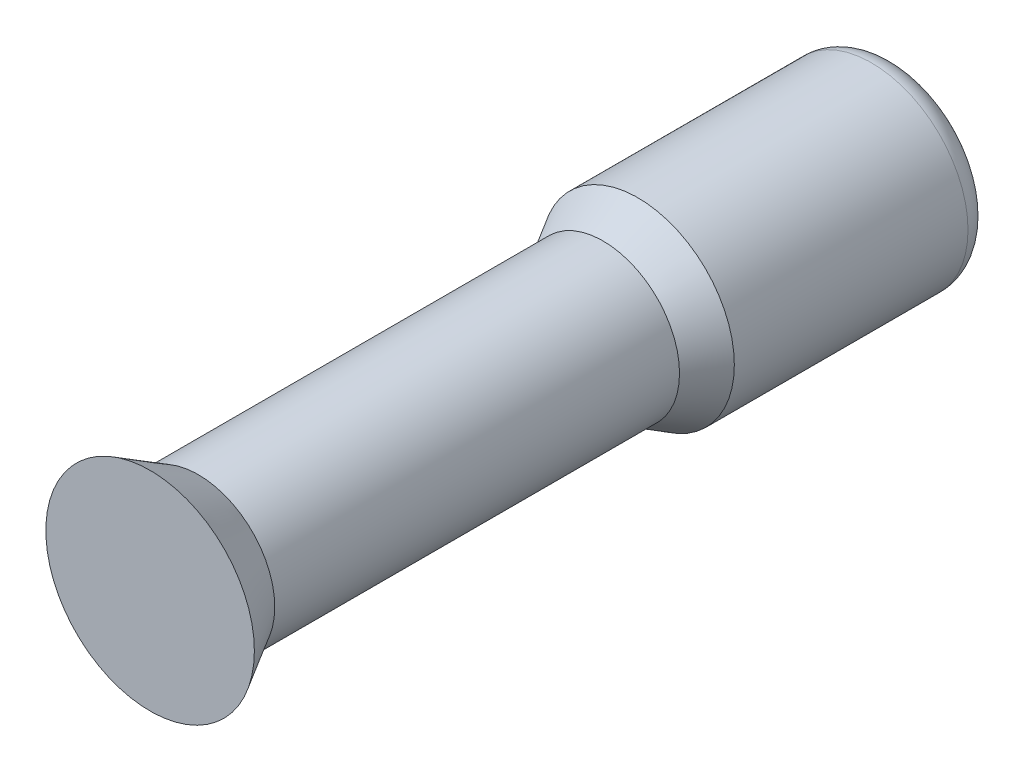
ISO-10303-21;
HEADER;
FILE_DESCRIPTION(('STEP AP214'),'2;1');
FILE_NAME('part.step','',(''),(''),'','','');
FILE_SCHEMA(('AUTOMOTIVE_DESIGN { 1 0 10303 214 1 1 1 1 }'));
ENDSEC;
DATA;
#1=APPLICATION_CONTEXT('core data for automotive mechanical design processes');
#2=APPLICATION_PROTOCOL_DEFINITION('international standard','automotive_design',2000,#1);
#3=PRODUCT_CONTEXT('',#1,'mechanical');
#4=PRODUCT('Part','Part','',(#3));
#5=PRODUCT_RELATED_PRODUCT_CATEGORY('part','',(#4));
#6=PRODUCT_DEFINITION_FORMATION('','',#4);
#7=PRODUCT_DEFINITION_CONTEXT('part definition',#1,'design');
#8=PRODUCT_DEFINITION('design','',#6,#7);
#9=PRODUCT_DEFINITION_SHAPE('','',#8);
#10=(LENGTH_UNIT() NAMED_UNIT(*) SI_UNIT(.MILLI.,.METRE.));
#11=(NAMED_UNIT(*) PLANE_ANGLE_UNIT() SI_UNIT($,.RADIAN.));
#12=(NAMED_UNIT(*) SI_UNIT($,.STERADIAN.) SOLID_ANGLE_UNIT());
#13=UNCERTAINTY_MEASURE_WITH_UNIT(LENGTH_MEASURE(1.E-05),#10,'distance_accuracy_value','');
#14=(GEOMETRIC_REPRESENTATION_CONTEXT(3) GLOBAL_UNCERTAINTY_ASSIGNED_CONTEXT((#13)) GLOBAL_UNIT_ASSIGNED_CONTEXT((#10,
#11,#12)) REPRESENTATION_CONTEXT('',''));
#15=CARTESIAN_POINT('',(0.,0.,0.));
#16=DIRECTION('',(0.,0.,1.));
#17=DIRECTION('',(1.,0.,0.));
#18=AXIS2_PLACEMENT_3D('',#15,#16,#17);
#19=CARTESIAN_POINT('',(0.,0.,0.));
#20=DIRECTION('',(0.,0.,-1.));
#21=DIRECTION('',(-1.,0.,0.));
#22=AXIS2_PLACEMENT_3D('',#19,#20,#21);
#23=PLANE('',#22);
#24=CARTESIAN_POINT('',(0.,0.,0.));
#25=DIRECTION('',(0.,0.,1.));
#26=DIRECTION('',(1.,0.,0.));
#27=AXIS2_PLACEMENT_3D('',#24,#25,#26);
#28=CIRCLE('',#27,1.71557177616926);
#29=CARTESIAN_POINT('',(1.71557177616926,0.,0.));
#30=VERTEX_POINT('',#29);
#31=EDGE_CURVE('E10',#30,#30,#28,.T.);
#32=ORIENTED_EDGE('',*,*,#31,.T.);
#33=EDGE_LOOP('',(#32));
#34=FACE_BOUND('',#33,.T.);
#35=ADVANCED_FACE('F33',(#34),#23,.F.);
#36=CARTESIAN_POINT('',(0.,0.,-0.79375));
#37=DIRECTION('',(0.,0.,1.));
#38=DIRECTION('',(1.,0.,0.));
#39=AXIS2_PLACEMENT_3D('',#36,#37,#38);
#40=CONICAL_SURFACE('',#39,1.2573,0.523598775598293);
#41=ORIENTED_EDGE('',*,*,#31,.F.);
#42=EDGE_LOOP('',(#41));
#43=FACE_BOUND('',#42,.T.);
#44=CARTESIAN_POINT('',(0.,0.,-0.79375));
#45=DIRECTION('',(0.,0.,1.));
#46=DIRECTION('',(1.,0.,0.));
#47=AXIS2_PLACEMENT_3D('',#44,#45,#46);
#48=CIRCLE('',#47,1.2573);
#49=CARTESIAN_POINT('',(1.2573,0.,-0.79375));
#50=VERTEX_POINT('',#49);
#51=EDGE_CURVE('E39',#50,#50,#48,.T.);
#52=ORIENTED_EDGE('',*,*,#51,.T.);
#53=EDGE_LOOP('',(#52));
#54=FACE_BOUND('',#53,.T.);
#55=ADVANCED_FACE('F71',(#43,#54),#40,.T.);
#56=CARTESIAN_POINT('',(0.,0.,0.));
#57=DIRECTION('',(0.,0.,1.));
#58=DIRECTION('',(1.,0.,0.));
#59=AXIS2_PLACEMENT_3D('',#56,#57,#58);
#60=CYLINDRICAL_SURFACE('',#59,1.2573);
#61=ORIENTED_EDGE('',*,*,#51,.F.);
#62=EDGE_LOOP('',(#61));
#63=FACE_BOUND('',#62,.T.);
#64=CARTESIAN_POINT('',(0.,0.,-7.45363));
#65=DIRECTION('',(0.,0.,1.));
#66=DIRECTION('',(1.,0.,0.));
#67=AXIS2_PLACEMENT_3D('',#64,#65,#66);
#68=CIRCLE('',#67,1.2573);
#69=CARTESIAN_POINT('',(1.2573,0.,-7.45363));
#70=VERTEX_POINT('',#69);
#71=EDGE_CURVE('E43',#70,#70,#68,.T.);
#72=ORIENTED_EDGE('',*,*,#71,.T.);
#73=EDGE_LOOP('',(#72));
#74=FACE_BOUND('',#73,.T.);
#75=ADVANCED_FACE('F75',(#63,#74),#60,.T.);
#76=CARTESIAN_POINT('',(0.,0.,-8.02555317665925));
#77=DIRECTION('',(0.,0.,-1.));
#78=DIRECTION('',(-1.,0.,0.));
#79=AXIS2_PLACEMENT_3D('',#76,#77,#78);
#80=CONICAL_SURFACE('',#79,1.5875,0.523598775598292);
#81=ORIENTED_EDGE('',*,*,#71,.F.);
#82=EDGE_LOOP('',(#81));
#83=FACE_BOUND('',#82,.T.);
#84=CARTESIAN_POINT('',(0.,0.,-8.02555317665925));
#85=DIRECTION('',(0.,0.,1.));
#86=DIRECTION('',(1.,0.,0.));
#87=AXIS2_PLACEMENT_3D('',#84,#85,#86);
#88=CIRCLE('',#87,1.5875);
#89=CARTESIAN_POINT('',(1.5875,0.,-8.02555317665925));
#90=VERTEX_POINT('',#89);
#91=EDGE_CURVE('E47',#90,#90,#88,.T.);
#92=ORIENTED_EDGE('',*,*,#91,.T.);
#93=EDGE_LOOP('',(#92));
#94=FACE_BOUND('',#93,.T.);
#95=ADVANCED_FACE('F80',(#83,#94),#80,.T.);
#96=CARTESIAN_POINT('',(0.,0.,0.));
#97=DIRECTION('',(0.,0.,1.));
#98=DIRECTION('',(1.,0.,0.));
#99=AXIS2_PLACEMENT_3D('',#96,#97,#98);
#100=CYLINDRICAL_SURFACE('',#99,1.5875);
#101=ORIENTED_EDGE('',*,*,#91,.F.);
#102=EDGE_LOOP('',(#101));
#103=FACE_BOUND('',#102,.T.);
#104=CARTESIAN_POINT('',(0.,0.,-11.8704781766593));
#105=DIRECTION('',(0.,0.,1.));
#106=DIRECTION('',(1.,0.,0.));
#107=AXIS2_PLACEMENT_3D('',#104,#105,#106);
#108=CIRCLE('',#107,1.5875);
#109=CARTESIAN_POINT('',(1.5875,0.,-11.8704781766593));
#110=VERTEX_POINT('',#109);
#111=EDGE_CURVE('E52',#110,#110,#108,.T.);
#112=ORIENTED_EDGE('',*,*,#111,.T.);
#113=EDGE_LOOP('',(#112));
#114=FACE_BOUND('',#113,.T.);
#115=ADVANCED_FACE('F67',(#103,#114),#100,.T.);
#116=CARTESIAN_POINT('',(0.,0.,-11.8704781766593));
#117=DIRECTION('',(0.,0.,1.));
#118=DIRECTION('',(1.,0.,0.));
#119=AXIS2_PLACEMENT_3D('',#116,#117,#118);
#120=TOROIDAL_SURFACE('',#119,1.190625,0.396875);
#121=ORIENTED_EDGE('',*,*,#111,.F.);
#122=EDGE_LOOP('',(#121));
#123=FACE_BOUND('',#122,.T.);
#124=CARTESIAN_POINT('',(0.,0.,-12.2673531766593));
#125=DIRECTION('',(0.,0.,1.));
#126=DIRECTION('',(1.,0.,0.));
#127=AXIS2_PLACEMENT_3D('',#124,#125,#126);
#128=CIRCLE('',#127,1.190625);
#129=CARTESIAN_POINT('',(1.190625,0.,-12.2673531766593));
#130=VERTEX_POINT('',#129);
#131=EDGE_CURVE('E55',#130,#130,#128,.T.);
#132=ORIENTED_EDGE('',*,*,#131,.T.);
#133=EDGE_LOOP('',(#132));
#134=FACE_BOUND('',#133,.T.);
#135=ADVANCED_FACE('F59',(#123,#134),#120,.T.);
#136=CARTESIAN_POINT('',(0.,1.190625,-12.2673531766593));
#137=DIRECTION('',(0.,0.,1.));
#138=DIRECTION('',(1.,0.,0.));
#139=AXIS2_PLACEMENT_3D('',#136,#137,#138);
#140=PLANE('',#139);
#141=ORIENTED_EDGE('',*,*,#131,.F.);
#142=EDGE_LOOP('',(#141));
#143=FACE_BOUND('',#142,.T.);
#144=ADVANCED_FACE('F61',(#143),#140,.F.);
#145=CLOSED_SHELL('',(#35,#55,#75,#95,#115,#135,#144));
#146=MANIFOLD_SOLID_BREP('B2',#145);
#147=ADVANCED_BREP_SHAPE_REPRESENTATION('',(#18,#146),#14);
#148=SHAPE_DEFINITION_REPRESENTATION(#9,#147);
ENDSEC;
END-ISO-10303-21;
